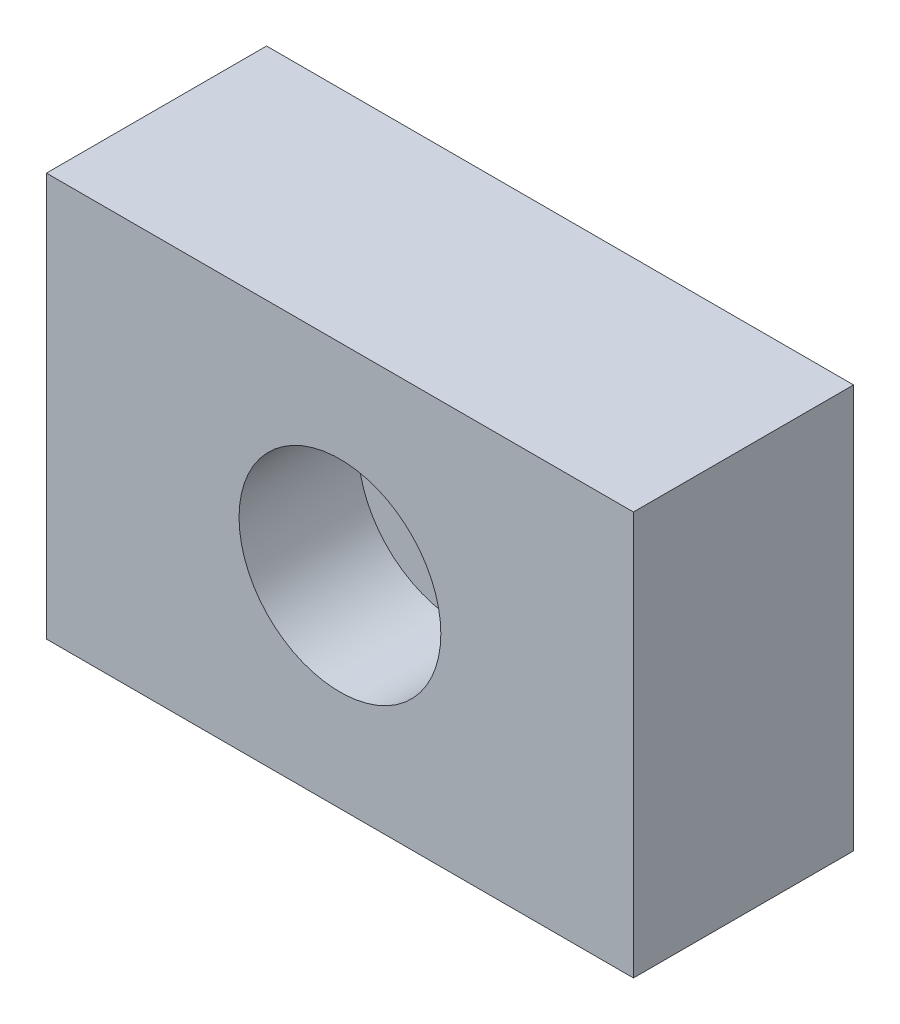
ISO-10303-21;
HEADER;
FILE_DESCRIPTION(('STEP AP214'),'2;1');
FILE_NAME('part.step','',(''),(''),'','','');
FILE_SCHEMA(('AUTOMOTIVE_DESIGN { 1 0 10303 214 1 1 1 1 }'));
ENDSEC;
DATA;
#1=APPLICATION_CONTEXT('core data for automotive mechanical design processes');
#2=APPLICATION_PROTOCOL_DEFINITION('international standard','automotive_design',2000,#1);
#3=PRODUCT_CONTEXT('',#1,'mechanical');
#4=PRODUCT('Part','Part','',(#3));
#5=PRODUCT_RELATED_PRODUCT_CATEGORY('part','',(#4));
#6=PRODUCT_DEFINITION_FORMATION('','',#4);
#7=PRODUCT_DEFINITION_CONTEXT('part definition',#1,'design');
#8=PRODUCT_DEFINITION('design','',#6,#7);
#9=PRODUCT_DEFINITION_SHAPE('','',#8);
#10=(LENGTH_UNIT() NAMED_UNIT(*) SI_UNIT(.MILLI.,.METRE.));
#11=(NAMED_UNIT(*) PLANE_ANGLE_UNIT() SI_UNIT($,.RADIAN.));
#12=(NAMED_UNIT(*) SI_UNIT($,.STERADIAN.) SOLID_ANGLE_UNIT());
#13=UNCERTAINTY_MEASURE_WITH_UNIT(LENGTH_MEASURE(1.E-05),#10,'distance_accuracy_value','');
#14=(GEOMETRIC_REPRESENTATION_CONTEXT(3) GLOBAL_UNCERTAINTY_ASSIGNED_CONTEXT((#13)) GLOBAL_UNIT_ASSIGNED_CONTEXT((#10,
#11,#12)) REPRESENTATION_CONTEXT('',''));
#15=CARTESIAN_POINT('',(0.,0.,0.));
#16=DIRECTION('',(0.,0.,1.));
#17=DIRECTION('',(1.,0.,0.));
#18=AXIS2_PLACEMENT_3D('',#15,#16,#17);
#19=CARTESIAN_POINT('',(16.,-11.,12.));
#20=DIRECTION('',(0.,0.,1.));
#21=DIRECTION('',(1.,0.,0.));
#22=AXIS2_PLACEMENT_3D('',#19,#20,#21);
#23=PLANE('',#22);
#24=DIRECTION('',(1.,0.,0.));
#25=VECTOR('',#24,1.);
#26=CARTESIAN_POINT('',(-16.,-11.,12.));
#27=LINE('',#26,#25);
#28=CARTESIAN_POINT('',(-16.,-11.,12.));
#29=VERTEX_POINT('',#28);
#30=CARTESIAN_POINT('',(16.,-11.,12.));
#31=VERTEX_POINT('',#30);
#32=EDGE_CURVE('E84',#29,#31,#27,.T.);
#33=ORIENTED_EDGE('',*,*,#32,.T.);
#34=DIRECTION('',(0.,1.,0.));
#35=VECTOR('',#34,1.);
#36=CARTESIAN_POINT('',(16.,-11.,12.));
#37=LINE('',#36,#35);
#38=CARTESIAN_POINT('',(16.,11.,12.));
#39=VERTEX_POINT('',#38);
#40=EDGE_CURVE('E61',#31,#39,#37,.T.);
#41=ORIENTED_EDGE('',*,*,#40,.T.);
#42=DIRECTION('',(-1.,0.,0.));
#43=VECTOR('',#42,1.);
#44=CARTESIAN_POINT('',(16.,11.,12.));
#45=LINE('',#44,#43);
#46=CARTESIAN_POINT('',(-16.,11.,12.));
#47=VERTEX_POINT('',#46);
#48=EDGE_CURVE('E81',#39,#47,#45,.T.);
#49=ORIENTED_EDGE('',*,*,#48,.T.);
#50=DIRECTION('',(0.,-1.,0.));
#51=VECTOR('',#50,1.);
#52=CARTESIAN_POINT('',(-16.,11.,12.));
#53=LINE('',#52,#51);
#54=EDGE_CURVE('E78',#47,#29,#53,.T.);
#55=ORIENTED_EDGE('',*,*,#54,.T.);
#56=EDGE_LOOP('',(#33,#41,#49,#55));
#57=FACE_BOUND('',#56,.T.);
#58=CARTESIAN_POINT('',(0.,0.,12.));
#59=DIRECTION('',(0.,0.,1.));
#60=DIRECTION('',(1.,0.,0.));
#61=AXIS2_PLACEMENT_3D('',#58,#59,#60);
#62=CIRCLE('',#61,5.5);
#63=CARTESIAN_POINT('',(5.5,0.,12.));
#64=VERTEX_POINT('',#63);
#65=EDGE_CURVE('E69',#64,#64,#62,.T.);
#66=ORIENTED_EDGE('',*,*,#65,.F.);
#67=EDGE_LOOP('',(#66));
#68=FACE_BOUND('',#67,.T.);
#69=ADVANCED_FACE('F14',(#57,#68),#23,.T.);
#70=CARTESIAN_POINT('',(-16.,-11.,12.));
#71=DIRECTION('',(0.,1.,0.));
#72=DIRECTION('',(0.,0.,1.));
#73=AXIS2_PLACEMENT_3D('',#70,#71,#72);
#74=PLANE('',#73);
#75=DIRECTION('',(0.,0.,-1.));
#76=VECTOR('',#75,1.);
#77=CARTESIAN_POINT('',(16.,-11.,12.));
#78=LINE('',#77,#76);
#79=CARTESIAN_POINT('',(16.,-11.,0.));
#80=VERTEX_POINT('',#79);
#81=EDGE_CURVE('E9',#31,#80,#78,.T.);
#82=ORIENTED_EDGE('',*,*,#81,.F.);
#83=ORIENTED_EDGE('',*,*,#32,.F.);
#84=DIRECTION('',(0.,0.,-1.));
#85=VECTOR('',#84,1.);
#86=CARTESIAN_POINT('',(-16.,-11.,12.));
#87=LINE('',#86,#85);
#88=CARTESIAN_POINT('',(-16.,-11.,0.));
#89=VERTEX_POINT('',#88);
#90=EDGE_CURVE('E29',#29,#89,#87,.T.);
#91=ORIENTED_EDGE('',*,*,#90,.T.);
#92=DIRECTION('',(1.,0.,0.));
#93=VECTOR('',#92,1.);
#94=CARTESIAN_POINT('',(-16.,-11.,0.));
#95=LINE('',#94,#93);
#96=EDGE_CURVE('E65',#89,#80,#95,.T.);
#97=ORIENTED_EDGE('',*,*,#96,.T.);
#98=EDGE_LOOP('',(#82,#83,#91,#97));
#99=FACE_BOUND('',#98,.T.);
#100=ADVANCED_FACE('F66',(#99),#74,.F.);
#101=CARTESIAN_POINT('',(16.,-11.,12.));
#102=DIRECTION('',(-1.,0.,0.));
#103=DIRECTION('',(0.,0.,1.));
#104=AXIS2_PLACEMENT_3D('',#101,#102,#103);
#105=PLANE('',#104);
#106=DIRECTION('',(0.,0.,-1.));
#107=VECTOR('',#106,1.);
#108=CARTESIAN_POINT('',(16.,11.,12.));
#109=LINE('',#108,#107);
#110=CARTESIAN_POINT('',(16.,11.,0.));
#111=VERTEX_POINT('',#110);
#112=EDGE_CURVE('E22',#39,#111,#109,.T.);
#113=ORIENTED_EDGE('',*,*,#112,.F.);
#114=ORIENTED_EDGE('',*,*,#40,.F.);
#115=ORIENTED_EDGE('',*,*,#81,.T.);
#116=DIRECTION('',(0.,1.,0.));
#117=VECTOR('',#116,1.);
#118=CARTESIAN_POINT('',(16.,-11.,0.));
#119=LINE('',#118,#117);
#120=EDGE_CURVE('E58',#80,#111,#119,.T.);
#121=ORIENTED_EDGE('',*,*,#120,.T.);
#122=EDGE_LOOP('',(#113,#114,#115,#121));
#123=FACE_BOUND('',#122,.T.);
#124=ADVANCED_FACE('F16',(#123),#105,.F.);
#125=CARTESIAN_POINT('',(16.,11.,12.));
#126=DIRECTION('',(0.,-1.,0.));
#127=DIRECTION('',(1.,0.,0.));
#128=AXIS2_PLACEMENT_3D('',#125,#126,#127);
#129=PLANE('',#128);
#130=DIRECTION('',(0.,0.,-1.));
#131=VECTOR('',#130,1.);
#132=CARTESIAN_POINT('',(-16.,11.,12.));
#133=LINE('',#132,#131);
#134=CARTESIAN_POINT('',(-16.,11.,0.));
#135=VERTEX_POINT('',#134);
#136=EDGE_CURVE('E37',#47,#135,#133,.T.);
#137=ORIENTED_EDGE('',*,*,#136,.F.);
#138=ORIENTED_EDGE('',*,*,#48,.F.);
#139=ORIENTED_EDGE('',*,*,#112,.T.);
#140=DIRECTION('',(-1.,0.,0.));
#141=VECTOR('',#140,1.);
#142=CARTESIAN_POINT('',(16.,11.,0.));
#143=LINE('',#142,#141);
#144=EDGE_CURVE('E72',#111,#135,#143,.T.);
#145=ORIENTED_EDGE('',*,*,#144,.T.);
#146=EDGE_LOOP('',(#137,#138,#139,#145));
#147=FACE_BOUND('',#146,.T.);
#148=ADVANCED_FACE('F87',(#147),#129,.F.);
#149=CARTESIAN_POINT('',(-16.,11.,12.));
#150=DIRECTION('',(1.,0.,0.));
#151=DIRECTION('',(0.,1.,0.));
#152=AXIS2_PLACEMENT_3D('',#149,#150,#151);
#153=PLANE('',#152);
#154=ORIENTED_EDGE('',*,*,#54,.F.);
#155=ORIENTED_EDGE('',*,*,#136,.T.);
#156=DIRECTION('',(0.,-1.,0.));
#157=VECTOR('',#156,1.);
#158=CARTESIAN_POINT('',(-16.,11.,0.));
#159=LINE('',#158,#157);
#160=EDGE_CURVE('E74',#135,#89,#159,.T.);
#161=ORIENTED_EDGE('',*,*,#160,.T.);
#162=ORIENTED_EDGE('',*,*,#90,.F.);
#163=EDGE_LOOP('',(#154,#155,#161,#162));
#164=FACE_BOUND('',#163,.T.);
#165=ADVANCED_FACE('F90',(#164),#153,.F.);
#166=CARTESIAN_POINT('',(16.,-11.,0.));
#167=DIRECTION('',(0.,0.,1.));
#168=DIRECTION('',(1.,0.,0.));
#169=AXIS2_PLACEMENT_3D('',#166,#167,#168);
#170=PLANE('',#169);
#171=CARTESIAN_POINT('',(0.,0.,0.));
#172=DIRECTION('',(0.,0.,1.));
#173=DIRECTION('',(1.,0.,0.));
#174=AXIS2_PLACEMENT_3D('',#171,#172,#173);
#175=CIRCLE('',#174,3.5);
#176=CARTESIAN_POINT('',(3.5,0.,0.));
#177=VERTEX_POINT('',#176);
#178=EDGE_CURVE('E100',#177,#177,#175,.T.);
#179=ORIENTED_EDGE('',*,*,#178,.T.);
#180=EDGE_LOOP('',(#179));
#181=FACE_BOUND('',#180,.T.);
#182=ORIENTED_EDGE('',*,*,#96,.F.);
#183=ORIENTED_EDGE('',*,*,#160,.F.);
#184=ORIENTED_EDGE('',*,*,#144,.F.);
#185=ORIENTED_EDGE('',*,*,#120,.F.);
#186=EDGE_LOOP('',(#182,#183,#184,#185));
#187=FACE_BOUND('',#186,.T.);
#188=ADVANCED_FACE('F71',(#181,#187),#170,.F.);
#189=CARTESIAN_POINT('',(0.,0.,12.));
#190=DIRECTION('',(0.,0.,1.));
#191=DIRECTION('',(1.,0.,0.));
#192=AXIS2_PLACEMENT_3D('',#189,#190,#191);
#193=CYLINDRICAL_SURFACE('',#192,5.5);
#194=ORIENTED_EDGE('',*,*,#65,.T.);
#195=EDGE_LOOP('',(#194));
#196=FACE_BOUND('',#195,.T.);
#197=CARTESIAN_POINT('',(0.,0.,5.5));
#198=DIRECTION('',(0.,0.,1.));
#199=DIRECTION('',(1.,0.,0.));
#200=AXIS2_PLACEMENT_3D('',#197,#198,#199);
#201=CIRCLE('',#200,5.5);
#202=CARTESIAN_POINT('',(5.5,0.,5.5));
#203=VERTEX_POINT('',#202);
#204=EDGE_CURVE('E94',#203,#203,#201,.T.);
#205=ORIENTED_EDGE('',*,*,#204,.F.);
#206=EDGE_LOOP('',(#205));
#207=FACE_BOUND('',#206,.T.);
#208=ADVANCED_FACE('F114',(#196,#207),#193,.F.);
#209=CARTESIAN_POINT('',(3.5,0.,5.5));
#210=DIRECTION('',(0.,0.,1.));
#211=DIRECTION('',(1.,0.,0.));
#212=AXIS2_PLACEMENT_3D('',#209,#210,#211);
#213=PLANE('',#212);
#214=ORIENTED_EDGE('',*,*,#204,.T.);
#215=EDGE_LOOP('',(#214));
#216=FACE_BOUND('',#215,.T.);
#217=CARTESIAN_POINT('',(0.,0.,5.5));
#218=DIRECTION('',(0.,0.,1.));
#219=DIRECTION('',(1.,0.,0.));
#220=AXIS2_PLACEMENT_3D('',#217,#218,#219);
#221=CIRCLE('',#220,3.5);
#222=CARTESIAN_POINT('',(3.5,0.,5.5));
#223=VERTEX_POINT('',#222);
#224=EDGE_CURVE('E97',#223,#223,#221,.T.);
#225=ORIENTED_EDGE('',*,*,#224,.F.);
#226=EDGE_LOOP('',(#225));
#227=FACE_BOUND('',#226,.T.);
#228=ADVANCED_FACE('F107',(#216,#227),#213,.T.);
#229=CARTESIAN_POINT('',(0.,0.,12.));
#230=DIRECTION('',(0.,0.,1.));
#231=DIRECTION('',(1.,0.,0.));
#232=AXIS2_PLACEMENT_3D('',#229,#230,#231);
#233=CYLINDRICAL_SURFACE('',#232,3.5);
#234=ORIENTED_EDGE('',*,*,#224,.T.);
#235=EDGE_LOOP('',(#234));
#236=FACE_BOUND('',#235,.T.);
#237=ORIENTED_EDGE('',*,*,#178,.F.);
#238=EDGE_LOOP('',(#237));
#239=FACE_BOUND('',#238,.T.);
#240=ADVANCED_FACE('F105',(#236,#239),#233,.F.);
#241=CLOSED_SHELL('',(#69,#100,#124,#148,#165,#188,#208,#228,#240));
#242=MANIFOLD_SOLID_BREP('B1',#241);
#243=ADVANCED_BREP_SHAPE_REPRESENTATION('',(#18,#242),#14);
#244=SHAPE_DEFINITION_REPRESENTATION(#9,#243);
ENDSEC;
END-ISO-10303-21;
